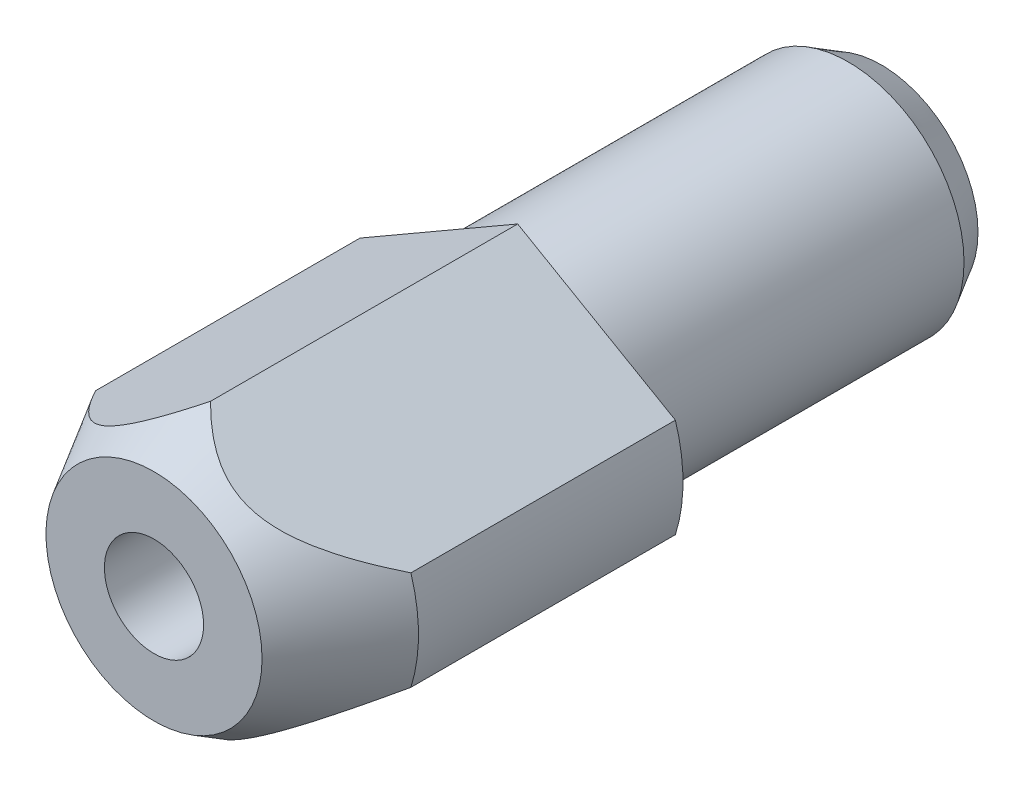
ISO-10303-21;
HEADER;
FILE_DESCRIPTION(('STEP AP214'),'2;1');
FILE_NAME('part.step','',(''),(''),'','','');
FILE_SCHEMA(('AUTOMOTIVE_DESIGN { 1 0 10303 214 1 1 1 1 }'));
ENDSEC;
DATA;
#1=APPLICATION_CONTEXT('core data for automotive mechanical design processes');
#2=APPLICATION_PROTOCOL_DEFINITION('international standard','automotive_design',2000,#1);
#3=PRODUCT_CONTEXT('',#1,'mechanical');
#4=PRODUCT('Part','Part','',(#3));
#5=PRODUCT_RELATED_PRODUCT_CATEGORY('part','',(#4));
#6=PRODUCT_DEFINITION_FORMATION('','',#4);
#7=PRODUCT_DEFINITION_CONTEXT('part definition',#1,'design');
#8=PRODUCT_DEFINITION('design','',#6,#7);
#9=PRODUCT_DEFINITION_SHAPE('','',#8);
#10=(LENGTH_UNIT() NAMED_UNIT(*) SI_UNIT(.MILLI.,.METRE.));
#11=(NAMED_UNIT(*) PLANE_ANGLE_UNIT() SI_UNIT($,.RADIAN.));
#12=(NAMED_UNIT(*) SI_UNIT($,.STERADIAN.) SOLID_ANGLE_UNIT());
#13=UNCERTAINTY_MEASURE_WITH_UNIT(LENGTH_MEASURE(1.E-05),#10,'distance_accuracy_value','');
#14=(GEOMETRIC_REPRESENTATION_CONTEXT(3) GLOBAL_UNCERTAINTY_ASSIGNED_CONTEXT((#13)) GLOBAL_UNIT_ASSIGNED_CONTEXT((#10,
#11,#12)) REPRESENTATION_CONTEXT('',''));
#15=CARTESIAN_POINT('',(0.,0.,0.));
#16=DIRECTION('',(0.,0.,1.));
#17=DIRECTION('',(1.,0.,0.));
#18=AXIS2_PLACEMENT_3D('',#15,#16,#17);
#19=CARTESIAN_POINT('',(3.5,0.,0.));
#20=DIRECTION('',(0.,0.,1.));
#21=DIRECTION('',(1.,0.,0.));
#22=AXIS2_PLACEMENT_3D('',#19,#20,#21);
#23=PLANE('',#22);
#24=CARTESIAN_POINT('',(0.,0.,0.));
#25=DIRECTION('',(0.,0.,1.));
#26=DIRECTION('',(1.,0.,0.));
#27=AXIS2_PLACEMENT_3D('',#24,#25,#26);
#28=CIRCLE('',#27,3.5);
#29=CARTESIAN_POINT('',(3.5,0.,0.));
#30=VERTEX_POINT('',#29);
#31=EDGE_CURVE('E96',#30,#30,#28,.T.);
#32=ORIENTED_EDGE('',*,*,#31,.T.);
#33=EDGE_LOOP('',(#32));
#34=FACE_BOUND('',#33,.T.);
#35=DIRECTION('',(-0.866025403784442,0.5,0.));
#36=VECTOR('',#35,1.);
#37=CARTESIAN_POINT('',(4.76969600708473,1.5,0.));
#38=LINE('',#37,#36);
#39=CARTESIAN_POINT('',(4.76969600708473,1.5,0.));
#40=VERTEX_POINT('',#39);
#41=CARTESIAN_POINT('',(0.,4.25378527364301,0.));
#42=VERTEX_POINT('',#41);
#43=EDGE_CURVE('E79',#40,#42,#38,.T.);
#44=ORIENTED_EDGE('',*,*,#43,.F.);
#45=CARTESIAN_POINT('',(0.,0.,0.));
#46=DIRECTION('',(0.,0.,1.));
#47=DIRECTION('',(1.,0.,0.));
#48=AXIS2_PLACEMENT_3D('',#45,#46,#47);
#49=CIRCLE('',#48,5.);
#50=CARTESIAN_POINT('',(4.76969600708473,-1.5,0.));
#51=VERTEX_POINT('',#50);
#52=EDGE_CURVE('E92',#51,#40,#49,.T.);
#53=ORIENTED_EDGE('',*,*,#52,.F.);
#54=DIRECTION('',(-0.866025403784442,-0.5,0.));
#55=VECTOR('',#54,1.);
#56=CARTESIAN_POINT('',(4.76969600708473,-1.5,0.));
#57=LINE('',#56,#55);
#58=CARTESIAN_POINT('',(0.,-4.25378527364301,0.));
#59=VERTEX_POINT('',#58);
#60=EDGE_CURVE('E201',#51,#59,#57,.T.);
#61=ORIENTED_EDGE('',*,*,#60,.T.);
#62=DIRECTION('',(0.866025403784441,-0.5,0.));
#63=VECTOR('',#62,1.);
#64=CARTESIAN_POINT('',(-4.76969600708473,-1.5,0.));
#65=LINE('',#64,#63);
#66=CARTESIAN_POINT('',(-4.76969600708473,-1.5,0.));
#67=VERTEX_POINT('',#66);
#68=EDGE_CURVE('E91',#67,#59,#65,.T.);
#69=ORIENTED_EDGE('',*,*,#68,.F.);
#70=CARTESIAN_POINT('',(-4.76969600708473,1.5,0.));
#71=VERTEX_POINT('',#70);
#72=EDGE_CURVE('E85',#71,#67,#49,.T.);
#73=ORIENTED_EDGE('',*,*,#72,.F.);
#74=DIRECTION('',(0.866025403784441,0.5,0.));
#75=VECTOR('',#74,1.);
#76=CARTESIAN_POINT('',(-4.76969600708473,1.5,0.));
#77=LINE('',#76,#75);
#78=EDGE_CURVE('E71',#71,#42,#77,.T.);
#79=ORIENTED_EDGE('',*,*,#78,.T.);
#80=EDGE_LOOP('',(#44,#53,#61,#69,#73,#79));
#81=FACE_BOUND('',#80,.T.);
#82=ADVANCED_FACE('F14',(#34,#81),#23,.F.);
#83=CARTESIAN_POINT('',(0.,0.,30.));
#84=DIRECTION('',(0.,0.,1.));
#85=DIRECTION('',(1.,0.,0.));
#86=AXIS2_PLACEMENT_3D('',#83,#84,#85);
#87=CYLINDRICAL_SURFACE('',#86,5.);
#88=DIRECTION('',(0.,0.,1.));
#89=VECTOR('',#88,1.);
#90=CARTESIAN_POINT('',(4.76969600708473,1.5,0.));
#91=LINE('',#90,#89);
#92=CARTESIAN_POINT('',(4.76969600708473,1.5,8.));
#93=VERTEX_POINT('',#92);
#94=EDGE_CURVE('E197',#40,#93,#91,.T.);
#95=ORIENTED_EDGE('',*,*,#94,.T.);
#96=CARTESIAN_POINT('',(0.,0.,8.));
#97=DIRECTION('',(0.,0.,1.));
#98=DIRECTION('',(1.,0.,0.));
#99=AXIS2_PLACEMENT_3D('',#96,#97,#98);
#100=CIRCLE('',#99,5.);
#101=CARTESIAN_POINT('',(4.76969600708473,-1.5,8.));
#102=VERTEX_POINT('',#101);
#103=EDGE_CURVE('E93',#102,#93,#100,.T.);
#104=ORIENTED_EDGE('',*,*,#103,.F.);
#105=DIRECTION('',(0.,0.,1.));
#106=VECTOR('',#105,1.);
#107=CARTESIAN_POINT('',(4.76969600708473,-1.5,0.));
#108=LINE('',#107,#106);
#109=EDGE_CURVE('E209',#51,#102,#108,.T.);
#110=ORIENTED_EDGE('',*,*,#109,.F.);
#111=ORIENTED_EDGE('',*,*,#52,.T.);
#112=EDGE_LOOP('',(#95,#104,#110,#111));
#113=FACE_BOUND('',#112,.T.);
#114=ADVANCED_FACE('F150',(#113),#87,.T.);
#115=CARTESIAN_POINT('',(0.,0.,8.));
#116=DIRECTION('',(0.,0.,-1.));
#117=DIRECTION('',(-1.,0.,0.));
#118=AXIS2_PLACEMENT_3D('',#115,#116,#117);
#119=CONICAL_SURFACE('',#118,5.,0.523598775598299);
#120=CARTESIAN_POINT('',(0.,0.,11.));
#121=DIRECTION('',(0.,0.,1.));
#122=DIRECTION('',(1.,0.,0.));
#123=AXIS2_PLACEMENT_3D('',#120,#121,#122);
#124=CIRCLE('',#123,3.26794919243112);
#125=CARTESIAN_POINT('',(3.26794919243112,0.,11.));
#126=VERTEX_POINT('',#125);
#127=EDGE_CURVE('E191',#126,#126,#124,.T.);
#128=ORIENTED_EDGE('',*,*,#127,.F.);
#129=EDGE_LOOP('',(#128));
#130=FACE_BOUND('',#129,.T.);
#131=CARTESIAN_POINT('',(-0.000200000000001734,4.25390074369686,9.29228181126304));
#132=CARTESIAN_POINT('',(0.0383232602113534,4.23165932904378,9.33080459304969));
#133=CARTESIAN_POINT('',(0.0772314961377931,4.20919564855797,9.36881387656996));
#134=CARTESIAN_POINT('',(0.155900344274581,4.16377616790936,9.44366116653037));
#135=CARTESIAN_POINT('',(0.19566117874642,4.14082023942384,9.48049886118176));
#136=CARTESIAN_POINT('',(0.316725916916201,4.07092348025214,9.58937696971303));
#137=CARTESIAN_POINT('',(0.399420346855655,4.02317982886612,9.65938596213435));
#138=CARTESIAN_POINT('',(0.571293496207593,3.92394881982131,9.79398825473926));
#139=CARTESIAN_POINT('',(0.660585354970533,3.87239614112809,9.85839154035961));
#140=CARTESIAN_POINT('',(0.843945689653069,3.76653300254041,9.97691885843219));
#141=CARTESIAN_POINT('',(0.938003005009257,3.71222898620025,10.0310656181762));
#142=CARTESIAN_POINT('',(1.13976873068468,3.5957394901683,10.130020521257));
#143=CARTESIAN_POINT('',(1.24795131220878,3.53328024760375,10.1735958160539));
#144=CARTESIAN_POINT('',(1.41329415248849,3.43781951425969,10.2231593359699));
#145=CARTESIAN_POINT('',(1.46871665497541,3.40582131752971,10.237025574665));
#146=CARTESIAN_POINT('',(1.58038760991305,3.34134806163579,10.2591308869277));
#147=CARTESIAN_POINT('',(1.63663566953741,3.30887322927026,10.2673725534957));
#148=CARTESIAN_POINT('',(1.75009913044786,3.24336506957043,10.2779487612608));
#149=CARTESIAN_POINT('',(1.80731862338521,3.21032937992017,10.2802252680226));
#150=CARTESIAN_POINT('',(1.92169033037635,3.14429684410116,10.2786078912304));
#151=CARTESIAN_POINT('',(1.978842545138,3.11129999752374,10.2747140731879));
#152=CARTESIAN_POINT('',(2.09268403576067,3.04557358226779,10.2609098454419));
#153=CARTESIAN_POINT('',(2.14937247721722,3.01284449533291,10.2509903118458));
#154=CARTESIAN_POINT('',(2.26180709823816,2.94793033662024,10.2255298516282));
#155=CARTESIAN_POINT('',(2.31755268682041,2.91574560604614,10.2099855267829));
#156=CARTESIAN_POINT('',(2.51435885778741,2.80211951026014,10.1453717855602));
#157=CARTESIAN_POINT('',(2.6519983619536,2.72265330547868,10.0819760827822));
#158=CARTESIAN_POINT('',(2.85112760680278,2.60768598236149,9.96919541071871));
#159=CARTESIAN_POINT('',(2.91659762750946,2.56988684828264,9.92839952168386));
#160=CARTESIAN_POINT('',(3.04511090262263,2.49568967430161,9.84197563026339));
#161=CARTESIAN_POINT('',(3.10815476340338,2.45929128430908,9.79634884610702));
#162=CARTESIAN_POINT('',(3.24864013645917,2.37818201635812,9.68837236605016));
#163=CARTESIAN_POINT('',(3.32538626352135,2.33387261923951,9.62482838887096));
#164=CARTESIAN_POINT('',(3.4756937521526,2.24709255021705,9.49287032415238));
#165=CARTESIAN_POINT('',(3.5492537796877,2.20462264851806,9.42445422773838));
#166=CARTESIAN_POINT('',(3.69378588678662,2.12117699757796,9.28364479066));
#167=CARTESIAN_POINT('',(3.76475040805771,2.08020561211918,9.21124116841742));
#168=CARTESIAN_POINT('',(3.90428118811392,1.99964747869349,9.06341230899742));
#169=CARTESIAN_POINT('',(3.97284718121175,1.9600608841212,8.98798673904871));
#170=CARTESIAN_POINT('',(4.10451079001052,1.88404486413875,8.83856927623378));
#171=CARTESIAN_POINT('',(4.16770996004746,1.84755680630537,8.76469621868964));
#172=CARTESIAN_POINT('',(4.2924899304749,1.77551505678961,8.61514387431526));
#173=CARTESIAN_POINT('',(4.35407061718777,1.73996143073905,8.53946446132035));
#174=CARTESIAN_POINT('',(4.47539394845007,1.66991537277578,8.38713887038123));
#175=CARTESIAN_POINT('',(4.53514639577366,1.63541728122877,8.31050307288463));
#176=CARTESIAN_POINT('',(4.65340823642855,1.5671387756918,8.15599347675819));
#177=CARTESIAN_POINT('',(4.71191791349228,1.53335819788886,8.07811996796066));
#178=CARTESIAN_POINT('',(4.76989600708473,1.49988452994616,7.99972954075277));
#179=B_SPLINE_CURVE_WITH_KNOTS('',3,(#131,#132,#133,#134,#135,#136,#137,#138,#139,#140,#141,
#142,#143,#144,#145,#146,#147,#148,#149,#150,#151,#152,#153,#154,#155,#156,#157,#158,#159,#160,
#161,#162,#163,#164,#165,#166,#167,#168,#169,#170,#171,#172,#173,#174,#175,#176,#177,#178),
.UNSPECIFIED.,.F.,.F.,(4,2,2,2,2,2,2,2,2,2,2,2,2,2,2,2,2,2,2,2,2,2,2,4),(0.,0.176528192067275,
0.353102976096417,0.708054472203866,1.07230829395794,1.43574527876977,1.83100537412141,
2.02723914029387,2.22338237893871,2.42142690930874,2.61946933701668,2.81781238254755,
3.01627545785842,3.5262333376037,3.78385768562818,4.04141722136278,4.36834511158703,
4.69540859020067,5.02335892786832,5.35134547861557,5.66282813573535,5.97433261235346,
6.28367121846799,6.59293842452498),.UNSPECIFIED.);
#180=CARTESIAN_POINT('',(0.,4.25378527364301,9.2924818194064));
#181=VERTEX_POINT('',#180);
#182=EDGE_CURVE('E9',#181,#93,#179,.T.);
#183=ORIENTED_EDGE('',*,*,#182,.F.);
#184=CARTESIAN_POINT('',(0.000199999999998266,4.25390074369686,9.29228181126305));
#185=CARTESIAN_POINT('',(-0.0383232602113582,4.23165932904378,9.3308045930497));
#186=CARTESIAN_POINT('',(-0.0772314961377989,4.20919564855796,9.36881387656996));
#187=CARTESIAN_POINT('',(-0.155900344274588,4.16377616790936,9.44366116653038));
#188=CARTESIAN_POINT('',(-0.195661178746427,4.14082023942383,9.48049886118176));
#189=CARTESIAN_POINT('',(-0.316725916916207,4.07092348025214,9.58937696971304));
#190=CARTESIAN_POINT('',(-0.399420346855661,4.02317982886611,9.65938596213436));
#191=CARTESIAN_POINT('',(-0.571293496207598,3.92394881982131,9.79398825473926));
#192=CARTESIAN_POINT('',(-0.660585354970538,3.87239614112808,9.85839154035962));
#193=CARTESIAN_POINT('',(-0.843945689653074,3.76653300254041,9.97691885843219));
#194=CARTESIAN_POINT('',(-0.938003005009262,3.71222898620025,10.0310656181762));
#195=CARTESIAN_POINT('',(-1.13976873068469,3.5957394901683,10.130020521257));
#196=CARTESIAN_POINT('',(-1.24795131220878,3.53328024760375,10.1735958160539));
#197=CARTESIAN_POINT('',(-1.4132941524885,3.43781951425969,10.2231593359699));
#198=CARTESIAN_POINT('',(-1.46871665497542,3.40582131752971,10.237025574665));
#199=CARTESIAN_POINT('',(-1.58038760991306,3.34134806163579,10.2591308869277));
#200=CARTESIAN_POINT('',(-1.63663566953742,3.30887322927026,10.2673725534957));
#201=CARTESIAN_POINT('',(-1.75009913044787,3.24336506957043,10.2779487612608));
#202=CARTESIAN_POINT('',(-1.80731862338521,3.21032937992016,10.2802252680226));
#203=CARTESIAN_POINT('',(-1.92169033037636,3.14429684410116,10.2786078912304));
#204=CARTESIAN_POINT('',(-1.97884254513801,3.11129999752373,10.2747140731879));
#205=CARTESIAN_POINT('',(-2.09268403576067,3.04557358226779,10.2609098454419));
#206=CARTESIAN_POINT('',(-2.14937247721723,3.01284449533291,10.2509903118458));
#207=CARTESIAN_POINT('',(-2.26180709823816,2.94793033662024,10.2255298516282));
#208=CARTESIAN_POINT('',(-2.31755268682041,2.91574560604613,10.2099855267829));
#209=CARTESIAN_POINT('',(-2.51435885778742,2.80211951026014,10.1453717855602));
#210=CARTESIAN_POINT('',(-2.65199836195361,2.72265330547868,10.0819760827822));
#211=CARTESIAN_POINT('',(-2.85112760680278,2.60768598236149,9.96919541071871));
#212=CARTESIAN_POINT('',(-2.91659762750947,2.56988684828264,9.92839952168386));
#213=CARTESIAN_POINT('',(-3.04511090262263,2.49568967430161,9.84197563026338));
#214=CARTESIAN_POINT('',(-3.10815476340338,2.45929128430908,9.79634884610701));
#215=CARTESIAN_POINT('',(-3.24864013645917,2.37818201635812,9.68837236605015));
#216=CARTESIAN_POINT('',(-3.32538626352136,2.33387261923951,9.62482838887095));
#217=CARTESIAN_POINT('',(-3.4756937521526,2.24709255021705,9.49287032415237));
#218=CARTESIAN_POINT('',(-3.54925377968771,2.20462264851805,9.42445422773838));
#219=CARTESIAN_POINT('',(-3.69378588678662,2.12117699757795,9.28364479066));
#220=CARTESIAN_POINT('',(-3.76475040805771,2.08020561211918,9.21124116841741));
#221=CARTESIAN_POINT('',(-3.90428118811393,1.99964747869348,9.06341230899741));
#222=CARTESIAN_POINT('',(-3.97284718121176,1.9600608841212,8.98798673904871));
#223=CARTESIAN_POINT('',(-4.10451079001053,1.88404486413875,8.83856927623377));
#224=CARTESIAN_POINT('',(-4.16770996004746,1.84755680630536,8.76469621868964));
#225=CARTESIAN_POINT('',(-4.2924899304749,1.77551505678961,8.61514387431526));
#226=CARTESIAN_POINT('',(-4.35407061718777,1.73996143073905,8.53946446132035));
#227=CARTESIAN_POINT('',(-4.47539394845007,1.66991537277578,8.38713887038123));
#228=CARTESIAN_POINT('',(-4.53514639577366,1.63541728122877,8.31050307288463));
#229=CARTESIAN_POINT('',(-4.65340823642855,1.5671387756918,8.15599347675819));
#230=CARTESIAN_POINT('',(-4.71191791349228,1.53335819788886,8.07811996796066));
#231=CARTESIAN_POINT('',(-4.76989600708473,1.49988452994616,7.99972954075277));
#232=B_SPLINE_CURVE_WITH_KNOTS('',3,(#184,#185,#186,#187,#188,#189,#190,#191,#192,#193,#194,
#195,#196,#197,#198,#199,#200,#201,#202,#203,#204,#205,#206,#207,#208,#209,#210,#211,#212,#213,
#214,#215,#216,#217,#218,#219,#220,#221,#222,#223,#224,#225,#226,#227,#228,#229,#230,#231),
.UNSPECIFIED.,.F.,.F.,(4,2,2,2,2,2,2,2,2,2,2,2,2,2,2,2,2,2,2,2,2,2,2,4),(0.,0.176528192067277,
0.353102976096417,0.708054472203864,1.07230829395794,1.43574527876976,1.83100537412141,
2.02723914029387,2.2233823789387,2.42142690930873,2.61946933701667,2.81781238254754,
3.01627545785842,3.52623333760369,3.78385768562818,4.04141722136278,4.36834511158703,
4.69540859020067,5.02335892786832,5.35134547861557,5.66282813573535,5.97433261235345,
6.28367121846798,6.59293842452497),.UNSPECIFIED.);
#233=CARTESIAN_POINT('',(-4.76969600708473,1.5,8.));
#234=VERTEX_POINT('',#233);
#235=EDGE_CURVE('E28',#181,#234,#232,.T.);
#236=ORIENTED_EDGE('',*,*,#235,.T.);
#237=CARTESIAN_POINT('',(-4.76969600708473,-1.5,8.));
#238=VERTEX_POINT('',#237);
#239=EDGE_CURVE('E87',#234,#238,#100,.T.);
#240=ORIENTED_EDGE('',*,*,#239,.T.);
#241=CARTESIAN_POINT('',(0.0001999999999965,-4.25390074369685,9.29228181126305));
#242=CARTESIAN_POINT('',(-0.0383232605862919,-4.23165932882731,9.33080459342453));
#243=CARTESIAN_POINT('',(-0.0772314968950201,-4.20919564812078,9.36881387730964));
#244=CARTESIAN_POINT('',(-0.155900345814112,-4.16377616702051,9.44366116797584));
#245=CARTESIAN_POINT('',(-0.195661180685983,-4.14082023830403,9.48049886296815));
#246=CARTESIAN_POINT('',(-0.316725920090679,-4.07092347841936,9.58937697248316));
#247=CARTESIAN_POINT('',(-0.399420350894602,-4.02317982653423,9.65938596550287));
#248=CARTESIAN_POINT('',(-0.571293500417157,-3.92394881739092,9.79398825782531));
#249=CARTESIAN_POINT('',(-0.660585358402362,-3.87239613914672,9.85839154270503));
#250=CARTESIAN_POINT('',(-0.843945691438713,-3.76653300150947,9.97691885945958));
#251=CARTESIAN_POINT('',(-0.938003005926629,-3.71222898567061,10.0310656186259));
#252=CARTESIAN_POINT('',(-1.13976873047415,-3.59573949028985,10.130020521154));
#253=CARTESIAN_POINT('',(-1.2479513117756,-3.53328024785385,10.1735958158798));
#254=CARTESIAN_POINT('',(-1.41329415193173,-3.43781951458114,10.2231593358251));
#255=CARTESIAN_POINT('',(-1.46871665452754,-3.40582131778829,10.2370255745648));
#256=CARTESIAN_POINT('',(-1.58038760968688,-3.34134806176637,10.2591308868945));
#257=CARTESIAN_POINT('',(-1.63663566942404,-3.30887322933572,10.2673725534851));
#258=CARTESIAN_POINT('',(-1.75009913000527,-3.24336506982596,10.2779487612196));
#259=CARTESIAN_POINT('',(-1.80731862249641,-3.21032938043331,10.2802252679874));
#260=CARTESIAN_POINT('',(-1.9216903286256,-3.14429684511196,10.2786078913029));
#261=CARTESIAN_POINT('',(-1.97884254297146,-3.11129999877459,10.2747140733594));
#262=CARTESIAN_POINT('',(-2.09268403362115,-3.04557358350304,10.2609098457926));
#263=CARTESIAN_POINT('',(-2.1493724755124,-3.01284449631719,10.2509903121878));
#264=CARTESIAN_POINT('',(-2.2618070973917,-2.94793033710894,10.2255298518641));
#265=CARTESIAN_POINT('',(-2.3175526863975,-2.9157456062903,10.209985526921));
#266=CARTESIAN_POINT('',(-2.51435886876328,-2.80211950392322,10.1453717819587));
#267=CARTESIAN_POINT('',(-2.65199838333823,-2.72265329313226,10.0819760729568));
#268=CARTESIAN_POINT('',(-2.85112763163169,-2.60768596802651,9.96919539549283));
#269=CARTESIAN_POINT('',(-2.91659764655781,-2.56988683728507,9.92839950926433));
#270=CARTESIAN_POINT('',(-3.04511091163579,-2.49568966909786,9.8419756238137));
#271=CARTESIAN_POINT('',(-3.10815476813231,-2.45929128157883,9.7963488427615));
#272=CARTESIAN_POINT('',(-3.24863718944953,-2.37818371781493,9.68837463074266));
#273=CARTESIAN_POINT('',(-3.32538050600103,-2.33387594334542,9.62483315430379));
#274=CARTESIAN_POINT('',(-3.47568259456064,-2.24709899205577,9.49288040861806));
#275=CARTESIAN_POINT('',(-3.54924003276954,-2.20463058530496,9.42446713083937));
#276=CARTESIAN_POINT('',(-3.69376711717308,-2.12118783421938,9.28366356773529));
#277=CARTESIAN_POINT('',(-3.76472920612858,-2.08021785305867,9.21126300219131));
#278=CARTESIAN_POINT('',(-3.90425526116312,-1.99966244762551,9.06344040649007));
#279=CARTESIAN_POINT('',(-3.97281896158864,-1.9600771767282,8.9880180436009));
#280=CARTESIAN_POINT('',(-4.10447837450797,-1.88406357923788,8.83860674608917));
#281=CARTESIAN_POINT('',(-4.16767563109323,-1.84757662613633,8.7647366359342));
#282=CARTESIAN_POINT('',(-4.29245184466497,-1.77553704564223,8.61519024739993));
#283=CARTESIAN_POINT('',(-4.35403068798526,-1.73998448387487,8.53951384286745));
#284=CARTESIAN_POINT('',(-4.47535043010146,-1.66994049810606,8.38719425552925));
#285=CARTESIAN_POINT('',(-4.53510113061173,-1.63544341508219,8.31056145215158));
#286=CARTESIAN_POINT('',(-4.65335952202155,-1.5671669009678,8.15605787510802));
#287=CARTESIAN_POINT('',(-4.7118674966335,-1.53338730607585,8.07818739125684));
#288=CARTESIAN_POINT('',(-4.76984390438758,-1.49991461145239,7.9998));
#289=B_SPLINE_CURVE_WITH_KNOTS('',3,(#241,#242,#243,#244,#245,#246,#247,#248,#249,#250,#251,
#252,#253,#254,#255,#256,#257,#258,#259,#260,#261,#262,#263,#264,#265,#266,#267,#268,#269,#270,
#271,#272,#273,#274,#275,#276,#277,#278,#279,#280,#281,#282,#283,#284,#285,#286,#287,#288),
.UNSPECIFIED.,.F.,.F.,(4,2,2,2,2,2,2,2,2,2,2,2,2,2,2,2,2,2,2,2,2,2,2,4),(0.,0.17652819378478,
0.35310297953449,0.70805447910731,1.07230829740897,1.43574527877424,1.83100537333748,
2.02723913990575,2.22338237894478,2.42142690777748,2.61946933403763,2.81781238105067,
3.01627545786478,3.52623337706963,3.78385770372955,4.04141722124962,4.36833285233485,
4.69538405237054,5.0233220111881,5.35129617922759,5.66276788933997,5.97426141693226,
6.28358929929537,6.59284578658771),.UNSPECIFIED.);
#290=CARTESIAN_POINT('',(0.,-4.25378527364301,9.2924818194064));
#291=VERTEX_POINT('',#290);
#292=EDGE_CURVE('E115',#291,#238,#289,.T.);
#293=ORIENTED_EDGE('',*,*,#292,.F.);
#294=CARTESIAN_POINT('',(-0.000200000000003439,-4.25390074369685,9.29228181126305));
#295=CARTESIAN_POINT('',(0.0383232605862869,-4.23165932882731,9.33080459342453));
#296=CARTESIAN_POINT('',(0.0772314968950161,-4.20919564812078,9.36881387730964));
#297=CARTESIAN_POINT('',(0.155900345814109,-4.16377616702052,9.44366116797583));
#298=CARTESIAN_POINT('',(0.19566118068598,-4.14082023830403,9.48049886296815));
#299=CARTESIAN_POINT('',(0.316725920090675,-4.07092347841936,9.58937697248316));
#300=CARTESIAN_POINT('',(0.399420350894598,-4.02317982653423,9.65938596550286));
#301=CARTESIAN_POINT('',(0.571293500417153,-3.92394881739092,9.79398825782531));
#302=CARTESIAN_POINT('',(0.660585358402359,-3.87239613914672,9.85839154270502));
#303=CARTESIAN_POINT('',(0.843945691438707,-3.76653300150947,9.97691885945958));
#304=CARTESIAN_POINT('',(0.938003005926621,-3.71222898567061,10.0310656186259));
#305=CARTESIAN_POINT('',(1.13976873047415,-3.59573949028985,10.130020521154));
#306=CARTESIAN_POINT('',(1.24795131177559,-3.53328024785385,10.1735958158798));
#307=CARTESIAN_POINT('',(1.41329415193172,-3.43781951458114,10.2231593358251));
#308=CARTESIAN_POINT('',(1.46871665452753,-3.40582131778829,10.2370255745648));
#309=CARTESIAN_POINT('',(1.58038760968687,-3.34134806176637,10.2591308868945));
#310=CARTESIAN_POINT('',(1.63663566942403,-3.30887322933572,10.2673725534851));
#311=CARTESIAN_POINT('',(1.75009913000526,-3.24336506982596,10.2779487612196));
#312=CARTESIAN_POINT('',(1.80731862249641,-3.21032938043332,10.2802252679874));
#313=CARTESIAN_POINT('',(1.92169032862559,-3.14429684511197,10.2786078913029));
#314=CARTESIAN_POINT('',(1.97884254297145,-3.1112999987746,10.2747140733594));
#315=CARTESIAN_POINT('',(2.09268403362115,-3.04557358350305,10.2609098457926));
#316=CARTESIAN_POINT('',(2.1493724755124,-3.0128444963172,10.2509903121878));
#317=CARTESIAN_POINT('',(2.26180709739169,-2.94793033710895,10.2255298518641));
#318=CARTESIAN_POINT('',(2.31755268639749,-2.9157456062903,10.209985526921));
#319=CARTESIAN_POINT('',(2.51435886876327,-2.80211950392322,10.1453717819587));
#320=CARTESIAN_POINT('',(2.65199838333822,-2.72265329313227,10.0819760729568));
#321=CARTESIAN_POINT('',(2.85112763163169,-2.60768596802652,9.96919539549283));
#322=CARTESIAN_POINT('',(2.91659764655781,-2.56988683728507,9.92839950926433));
#323=CARTESIAN_POINT('',(3.04511091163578,-2.49568966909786,9.8419756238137));
#324=CARTESIAN_POINT('',(3.10815476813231,-2.45929128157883,9.79634884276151));
#325=CARTESIAN_POINT('',(3.24863718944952,-2.37818371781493,9.68837463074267));
#326=CARTESIAN_POINT('',(3.32538050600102,-2.33387594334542,9.6248331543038));
#327=CARTESIAN_POINT('',(3.47568259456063,-2.24709899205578,9.49288040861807));
#328=CARTESIAN_POINT('',(3.54924003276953,-2.20463058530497,9.42446713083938));
#329=CARTESIAN_POINT('',(3.69376711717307,-2.12118783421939,9.2836635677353));
#330=CARTESIAN_POINT('',(3.76472920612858,-2.08021785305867,9.21126300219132));
#331=CARTESIAN_POINT('',(3.90425526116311,-1.99966244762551,9.06344040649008));
#332=CARTESIAN_POINT('',(3.97281896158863,-1.96007717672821,8.98801804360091));
#333=CARTESIAN_POINT('',(4.10447837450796,-1.88406357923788,8.83860674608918));
#334=CARTESIAN_POINT('',(4.16767563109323,-1.84757662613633,8.7647366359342));
#335=CARTESIAN_POINT('',(4.29245184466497,-1.77553704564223,8.61519024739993));
#336=CARTESIAN_POINT('',(4.35403068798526,-1.73998448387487,8.53951384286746));
#337=CARTESIAN_POINT('',(4.47535043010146,-1.66994049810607,8.38719425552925));
#338=CARTESIAN_POINT('',(4.53510113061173,-1.63544341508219,8.31056145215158));
#339=CARTESIAN_POINT('',(4.65335952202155,-1.5671669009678,8.15605787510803));
#340=CARTESIAN_POINT('',(4.7118674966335,-1.53338730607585,8.07818739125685));
#341=CARTESIAN_POINT('',(4.76984390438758,-1.49991461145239,7.9998));
#342=B_SPLINE_CURVE_WITH_KNOTS('',3,(#294,#295,#296,#297,#298,#299,#300,#301,#302,#303,#304,
#305,#306,#307,#308,#309,#310,#311,#312,#313,#314,#315,#316,#317,#318,#319,#320,#321,#322,#323,
#324,#325,#326,#327,#328,#329,#330,#331,#332,#333,#334,#335,#336,#337,#338,#339,#340,#341),
.UNSPECIFIED.,.F.,.F.,(4,2,2,2,2,2,2,2,2,2,2,2,2,2,2,2,2,2,2,2,2,2,2,4),(0.,0.17652819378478,
0.35310297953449,0.708054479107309,1.07230829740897,1.43574527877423,1.83100537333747,
2.02723913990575,2.22338237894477,2.42142690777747,2.61946933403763,2.81781238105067,
3.01627545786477,3.52623337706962,3.78385770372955,4.04141722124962,4.36833285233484,
4.69538405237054,5.0233220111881,5.35129617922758,5.66276788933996,5.97426141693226,
6.28358929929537,6.59284578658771),.UNSPECIFIED.);
#343=EDGE_CURVE('E122',#291,#102,#342,.T.);
#344=ORIENTED_EDGE('',*,*,#343,.T.);
#345=ORIENTED_EDGE('',*,*,#103,.T.);
#346=EDGE_LOOP('',(#183,#236,#240,#293,#344,#345));
#347=FACE_BOUND('',#346,.T.);
#348=ADVANCED_FACE('F128',(#130,#347),#119,.T.);
#349=CARTESIAN_POINT('',(0.,0.,-7.));
#350=DIRECTION('',(0.,0.,1.));
#351=DIRECTION('',(1.,0.,0.));
#352=AXIS2_PLACEMENT_3D('',#349,#350,#351);
#353=PLANE('',#352);
#354=CARTESIAN_POINT('',(0.,0.,-7.));
#355=DIRECTION('',(0.,0.,1.));
#356=DIRECTION('',(1.,0.,0.));
#357=AXIS2_PLACEMENT_3D('',#354,#355,#356);
#358=CIRCLE('',#357,1.);
#359=CARTESIAN_POINT('',(1.,0.,-7.));
#360=VERTEX_POINT('',#359);
#361=EDGE_CURVE('E112',#360,#360,#358,.T.);
#362=ORIENTED_EDGE('',*,*,#361,.F.);
#363=EDGE_LOOP('',(#362));
#364=FACE_BOUND('',#363,.T.);
#365=ADVANCED_FACE('F16',(#364),#353,.F.);
#366=CARTESIAN_POINT('',(0.,0.,30.));
#367=DIRECTION('',(0.,0.,1.));
#368=DIRECTION('',(1.,0.,0.));
#369=AXIS2_PLACEMENT_3D('',#366,#367,#368);
#370=CYLINDRICAL_SURFACE('',#369,1.);
#371=CARTESIAN_POINT('',(0.,0.,-11.));
#372=DIRECTION('',(0.,0.,1.));
#373=DIRECTION('',(1.,0.,0.));
#374=AXIS2_PLACEMENT_3D('',#371,#372,#373);
#375=CIRCLE('',#374,1.);
#376=CARTESIAN_POINT('',(1.,0.,-11.));
#377=VERTEX_POINT('',#376);
#378=EDGE_CURVE('E109',#377,#377,#375,.T.);
#379=ORIENTED_EDGE('',*,*,#378,.F.);
#380=EDGE_LOOP('',(#379));
#381=FACE_BOUND('',#380,.T.);
#382=ORIENTED_EDGE('',*,*,#361,.T.);
#383=EDGE_LOOP('',(#382));
#384=FACE_BOUND('',#383,.T.);
#385=ADVANCED_FACE('F170',(#381,#384),#370,.F.);
#386=CARTESIAN_POINT('',(1.,0.,-11.));
#387=DIRECTION('',(0.,0.,1.));
#388=DIRECTION('',(1.,0.,0.));
#389=AXIS2_PLACEMENT_3D('',#386,#387,#388);
#390=PLANE('',#389);
#391=CARTESIAN_POINT('',(0.,0.,-11.));
#392=DIRECTION('',(0.,0.,1.));
#393=DIRECTION('',(1.,0.,0.));
#394=AXIS2_PLACEMENT_3D('',#391,#392,#393);
#395=CIRCLE('',#394,2.92264973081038);
#396=CARTESIAN_POINT('',(2.92264973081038,0.,-11.));
#397=VERTEX_POINT('',#396);
#398=EDGE_CURVE('E106',#397,#397,#395,.T.);
#399=ORIENTED_EDGE('',*,*,#398,.F.);
#400=EDGE_LOOP('',(#399));
#401=FACE_BOUND('',#400,.T.);
#402=ORIENTED_EDGE('',*,*,#378,.T.);
#403=EDGE_LOOP('',(#402));
#404=FACE_BOUND('',#403,.T.);
#405=ADVANCED_FACE('F167',(#401,#404),#390,.F.);
#406=CARTESIAN_POINT('',(0.,0.,-10.));
#407=DIRECTION('',(0.,0.,1.));
#408=DIRECTION('',(1.,0.,0.));
#409=AXIS2_PLACEMENT_3D('',#406,#407,#408);
#410=CONICAL_SURFACE('',#409,3.5,0.523598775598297);
#411=ORIENTED_EDGE('',*,*,#398,.T.);
#412=EDGE_LOOP('',(#411));
#413=FACE_BOUND('',#412,.T.);
#414=CARTESIAN_POINT('',(0.,0.,-10.));
#415=DIRECTION('',(0.,0.,1.));
#416=DIRECTION('',(1.,0.,0.));
#417=AXIS2_PLACEMENT_3D('',#414,#415,#416);
#418=CIRCLE('',#417,3.5);
#419=CARTESIAN_POINT('',(3.5,0.,-10.));
#420=VERTEX_POINT('',#419);
#421=EDGE_CURVE('E103',#420,#420,#418,.T.);
#422=ORIENTED_EDGE('',*,*,#421,.F.);
#423=EDGE_LOOP('',(#422));
#424=FACE_BOUND('',#423,.T.);
#425=ADVANCED_FACE('F163',(#413,#424),#410,.T.);
#426=CARTESIAN_POINT('',(0.,0.,30.));
#427=DIRECTION('',(0.,0.,1.));
#428=DIRECTION('',(1.,0.,0.));
#429=AXIS2_PLACEMENT_3D('',#426,#427,#428);
#430=CYLINDRICAL_SURFACE('',#429,3.5);
#431=ORIENTED_EDGE('',*,*,#31,.F.);
#432=EDGE_LOOP('',(#431));
#433=FACE_BOUND('',#432,.T.);
#434=ORIENTED_EDGE('',*,*,#421,.T.);
#435=EDGE_LOOP('',(#434));
#436=FACE_BOUND('',#435,.T.);
#437=ADVANCED_FACE('F149',(#433,#436),#430,.T.);
#438=ORIENTED_EDGE('',*,*,#239,.F.);
#439=DIRECTION('',(0.,0.,1.));
#440=VECTOR('',#439,1.);
#441=CARTESIAN_POINT('',(-4.76969600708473,1.5,0.));
#442=LINE('',#441,#440);
#443=EDGE_CURVE('E35',#71,#234,#442,.T.);
#444=ORIENTED_EDGE('',*,*,#443,.F.);
#445=ORIENTED_EDGE('',*,*,#72,.T.);
#446=DIRECTION('',(0.,0.,1.));
#447=VECTOR('',#446,1.);
#448=CARTESIAN_POINT('',(-4.76969600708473,-1.5,0.));
#449=LINE('',#448,#447);
#450=EDGE_CURVE('E207',#67,#238,#449,.T.);
#451=ORIENTED_EDGE('',*,*,#450,.T.);
#452=EDGE_LOOP('',(#438,#444,#445,#451));
#453=FACE_BOUND('',#452,.T.);
#454=ADVANCED_FACE('F83',(#453),#87,.T.);
#455=CARTESIAN_POINT('',(3.26794919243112,0.,11.));
#456=DIRECTION('',(0.,0.,-1.));
#457=DIRECTION('',(-1.,0.,0.));
#458=AXIS2_PLACEMENT_3D('',#455,#456,#457);
#459=PLANE('',#458);
#460=CARTESIAN_POINT('',(0.,0.,11.));
#461=DIRECTION('',(0.,0.,1.));
#462=DIRECTION('',(1.,0.,0.));
#463=AXIS2_PLACEMENT_3D('',#460,#461,#462);
#464=CIRCLE('',#463,1.5);
#465=CARTESIAN_POINT('',(1.5,0.,11.));
#466=VERTEX_POINT('',#465);
#467=EDGE_CURVE('E211',#466,#466,#464,.T.);
#468=ORIENTED_EDGE('',*,*,#467,.F.);
#469=EDGE_LOOP('',(#468));
#470=FACE_BOUND('',#469,.T.);
#471=ORIENTED_EDGE('',*,*,#127,.T.);
#472=EDGE_LOOP('',(#471));
#473=FACE_BOUND('',#472,.T.);
#474=ADVANCED_FACE('F141',(#470,#473),#459,.F.);
#475=CARTESIAN_POINT('',(0.,0.,30.));
#476=DIRECTION('',(0.,0.,1.));
#477=DIRECTION('',(1.,0.,0.));
#478=AXIS2_PLACEMENT_3D('',#475,#476,#477);
#479=CYLINDRICAL_SURFACE('',#478,1.5);
#480=CARTESIAN_POINT('',(0.,0.,6.5));
#481=DIRECTION('',(0.,0.,1.));
#482=DIRECTION('',(1.,0.,0.));
#483=AXIS2_PLACEMENT_3D('',#480,#481,#482);
#484=CIRCLE('',#483,1.5);
#485=CARTESIAN_POINT('',(1.5,0.,6.5));
#486=VERTEX_POINT('',#485);
#487=EDGE_CURVE('E324',#486,#486,#484,.T.);
#488=ORIENTED_EDGE('',*,*,#487,.F.);
#489=EDGE_LOOP('',(#488));
#490=FACE_BOUND('',#489,.T.);
#491=ORIENTED_EDGE('',*,*,#467,.T.);
#492=EDGE_LOOP('',(#491));
#493=FACE_BOUND('',#492,.T.);
#494=ADVANCED_FACE('F139',(#490,#493),#479,.F.);
#495=CARTESIAN_POINT('',(4.76969600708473,-1.5,0.));
#496=DIRECTION('',(-0.5,0.866025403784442,0.));
#497=DIRECTION('',(-0.866025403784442,-0.5,0.));
#498=AXIS2_PLACEMENT_3D('',#495,#496,#497);
#499=PLANE('',#498);
#500=DIRECTION('',(0.,0.,1.));
#501=VECTOR('',#500,1.);
#502=CARTESIAN_POINT('',(0.,-4.25378527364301,0.));
#503=LINE('',#502,#501);
#504=EDGE_CURVE('E43',#59,#291,#503,.T.);
#505=ORIENTED_EDGE('',*,*,#504,.F.);
#506=ORIENTED_EDGE('',*,*,#60,.F.);
#507=ORIENTED_EDGE('',*,*,#109,.T.);
#508=ORIENTED_EDGE('',*,*,#343,.F.);
#509=EDGE_LOOP('',(#505,#506,#507,#508));
#510=FACE_BOUND('',#509,.T.);
#511=ADVANCED_FACE('F137',(#510),#499,.F.);
#512=CARTESIAN_POINT('',(-4.76969600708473,-1.5,0.));
#513=DIRECTION('',(-0.5,-0.866025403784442,0.));
#514=DIRECTION('',(0.866025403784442,-0.5,0.));
#515=AXIS2_PLACEMENT_3D('',#512,#513,#514);
#516=PLANE('',#515);
#517=ORIENTED_EDGE('',*,*,#292,.T.);
#518=ORIENTED_EDGE('',*,*,#450,.F.);
#519=ORIENTED_EDGE('',*,*,#68,.T.);
#520=ORIENTED_EDGE('',*,*,#504,.T.);
#521=EDGE_LOOP('',(#517,#518,#519,#520));
#522=FACE_BOUND('',#521,.T.);
#523=ADVANCED_FACE('F132',(#522),#516,.T.);
#524=CARTESIAN_POINT('',(4.76969600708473,1.5,0.));
#525=DIRECTION('',(0.5,0.866025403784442,0.));
#526=DIRECTION('',(-0.866025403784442,0.5,0.));
#527=AXIS2_PLACEMENT_3D('',#524,#525,#526);
#528=PLANE('',#527);
#529=ORIENTED_EDGE('',*,*,#182,.T.);
#530=ORIENTED_EDGE('',*,*,#94,.F.);
#531=ORIENTED_EDGE('',*,*,#43,.T.);
#532=DIRECTION('',(0.,0.,1.));
#533=VECTOR('',#532,1.);
#534=CARTESIAN_POINT('',(0.,4.25378527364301,0.));
#535=LINE('',#534,#533);
#536=EDGE_CURVE('E74',#42,#181,#535,.T.);
#537=ORIENTED_EDGE('',*,*,#536,.T.);
#538=EDGE_LOOP('',(#529,#530,#531,#537));
#539=FACE_BOUND('',#538,.T.);
#540=ADVANCED_FACE('F136',(#539),#528,.T.);
#541=CARTESIAN_POINT('',(-4.76969600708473,1.5,0.));
#542=DIRECTION('',(0.5,-0.866025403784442,0.));
#543=DIRECTION('',(0.866025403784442,0.5,0.));
#544=AXIS2_PLACEMENT_3D('',#541,#542,#543);
#545=PLANE('',#544);
#546=ORIENTED_EDGE('',*,*,#536,.F.);
#547=ORIENTED_EDGE('',*,*,#78,.F.);
#548=ORIENTED_EDGE('',*,*,#443,.T.);
#549=ORIENTED_EDGE('',*,*,#235,.F.);
#550=EDGE_LOOP('',(#546,#547,#548,#549));
#551=FACE_BOUND('',#550,.T.);
#552=ADVANCED_FACE('F72',(#551),#545,.F.);
#553=CARTESIAN_POINT('',(0.,0.,6.5));
#554=DIRECTION('',(0.,0.,1.));
#555=DIRECTION('',(1.,0.,0.));
#556=AXIS2_PLACEMENT_3D('',#553,#554,#555);
#557=PLANE('',#556);
#558=ORIENTED_EDGE('',*,*,#487,.T.);
#559=EDGE_LOOP('',(#558));
#560=FACE_BOUND('',#559,.T.);
#561=ADVANCED_FACE('F223',(#560),#557,.T.);
#562=CLOSED_SHELL('',(#82,#114,#348,#365,#385,#405,#425,#437,#454,#474,#494,#511,#523,#540,#552,#561));
#563=MANIFOLD_SOLID_BREP('B1',#562);
#564=ADVANCED_BREP_SHAPE_REPRESENTATION('',(#18,#563),#14);
#565=SHAPE_DEFINITION_REPRESENTATION(#9,#564);
ENDSEC;
END-ISO-10303-21;
